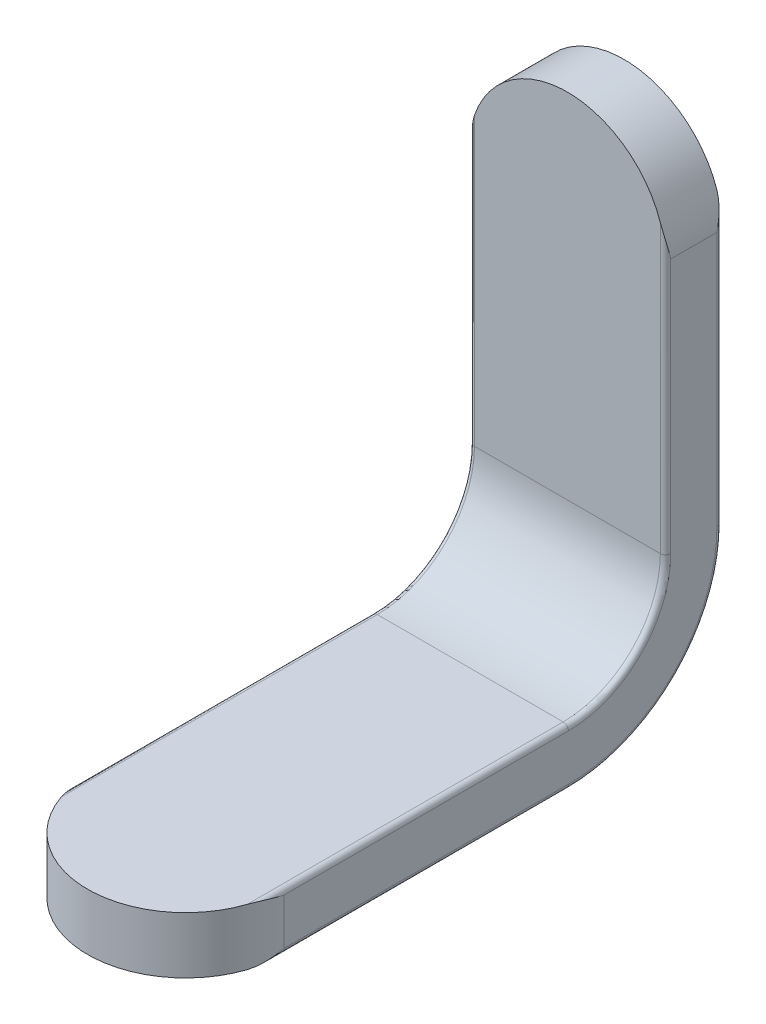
from build123d import *

# Parameters (mm, degrees)
EXTRUDE1_DEPTH     = 30
CUT_EXTRUDE1_DEPTH = 216.5130854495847
CUT_EXTRUDE2_DEPTH = 217.23434047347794


with BuildPart() as part:
    # Sketch1 → Extrude1 (new, symmetric)
    with BuildSketch(Plane(origin=(0, 0, 0), x_dir=(0, 0, -1), z_dir=(1, 0, 0))):
        with BuildLine():
            Line((8.2e-16, 155), (3.47e-15, 46.99999999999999))
            ThreePointArc((3.47e-15, 46.99999999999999), (-13.76598128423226, 13.765981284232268), (-46.999999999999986, 0))
            Line((-46.999999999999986, 0), (-163.99999999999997, -1.433e-14))
            Line((-163.99999999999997, -1.433e-14), (-163.99999999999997, 17.299999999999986))
            Line((-163.99999999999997, 17.299999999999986), (-47, 17.299999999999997))
            ThreePointArc((-47, 17.299999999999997), (-25.998928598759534, 25.998928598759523), (-17.29999999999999, 46.999999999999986))
            Line((-17.29999999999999, 46.999999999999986), (-17.3, 155))
            Line((-17.3, 155), (8.2e-16, 155))
        make_face()
    extrude(amount=EXTRUDE1_DEPTH, both=True)

    # Sketch2 → Cut-Extrude1 (cut, through all)
    with BuildSketch(Plane.XY.offset(17.299999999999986)):
        with BuildLine():
            Line((30, 125), (29.999999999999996, 156))
            Line((29.999999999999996, 156), (-30, 156))
            Line((-30, 156), (-29.999999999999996, 125))
            ThreePointArc((-29.999999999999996, 125), (1.84e-15, 155), (30, 125))
        make_face()
    extrude(amount=-CUT_EXTRUDE1_DEPTH, mode=Mode.SUBTRACT)

    # Sketch3 → Cut-Extrude2 (cut, through all)
    with BuildSketch(Plane(origin=(0, 17.3, 1.54e-15), x_dir=(-1, 0, 0), z_dir=(0, 1, 8e-17))):
        with BuildLine():
            Line((30, 133.99999999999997), (30, 164.99999999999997))
            Line((30, 164.99999999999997), (-30.000000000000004, 164.99999999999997))
            Line((-30.000000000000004, 164.99999999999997), (-30, 133.99999999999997))
            ThreePointArc((-30, 133.99999999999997), (7.04e-15, 163.99999999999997), (30, 133.99999999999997))
        make_face()
    extrude(amount=-CUT_EXTRUDE2_DEPTH, mode=Mode.SUBTRACT)

    # Cut-Sweep1: sweep along a path in Sketch4
    with BuildLine(Plane(origin=(0, 0, 0), x_dir=(0, 0, -1), z_dir=(1, 0, 0))) as cut_sweep1_path:
        Line((-163.99999999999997, 8.650000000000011), (-46.999999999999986, 8.650000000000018))
        ThreePointArc((-46.999999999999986, 8.650000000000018), (-19.882454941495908, 19.882454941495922), (-8.650000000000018, 47))
        Line((-8.650000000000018, 47), (-8.650000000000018, 155))
    # Sketch5 → Cut-Sweep1 (sweep, cut)
    with BuildSketch(Plane(origin=(0, 8.650000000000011, 163.99999999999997), x_dir=(1, 0, 0), z_dir=(0, 0, 1))):
        with BuildLine():
            Line((-28.410000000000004, 8.650000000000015), (-30.000000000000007, 8.650000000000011))
            Line((-30.000000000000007, 8.650000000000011), (-30.000000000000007, 7.060000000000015))
            ThreePointArc((-30.000000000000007, 7.060000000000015), (-29.534299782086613, 8.184299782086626), (-28.410000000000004, 8.650000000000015))
        make_face()
        with BuildLine():
            Line((-30.000000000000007, -8.650000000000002), (-30.000000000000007, -7.060000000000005))
            ThreePointArc((-30.000000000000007, -7.060000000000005), (-29.534299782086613, -8.184299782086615), (-28.410000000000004, -8.650000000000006))
            Line((-28.410000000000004, -8.650000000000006), (-30.000000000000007, -8.650000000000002))
        make_face()
        with BuildLine():
            Line((28.410000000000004, -8.650000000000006), (30.000000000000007, -8.650000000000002))
            Line((30.000000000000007, -8.650000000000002), (30.000000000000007, -7.060000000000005))
            ThreePointArc((30.000000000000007, -7.060000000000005), (29.534299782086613, -8.184299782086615), (28.410000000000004, -8.650000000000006))
        make_face()
        with BuildLine():
            Line((30.000000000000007, 8.650000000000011), (30.000000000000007, 7.060000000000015))
            ThreePointArc((30.000000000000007, 7.060000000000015), (29.534299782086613, 8.184299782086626), (28.410000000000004, 8.650000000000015))
            Line((28.410000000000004, 8.650000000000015), (30.000000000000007, 8.650000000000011))
        make_face()
    sweep(path=cut_sweep1_path.line, mode=Mode.SUBTRACT)


solid = part.part
